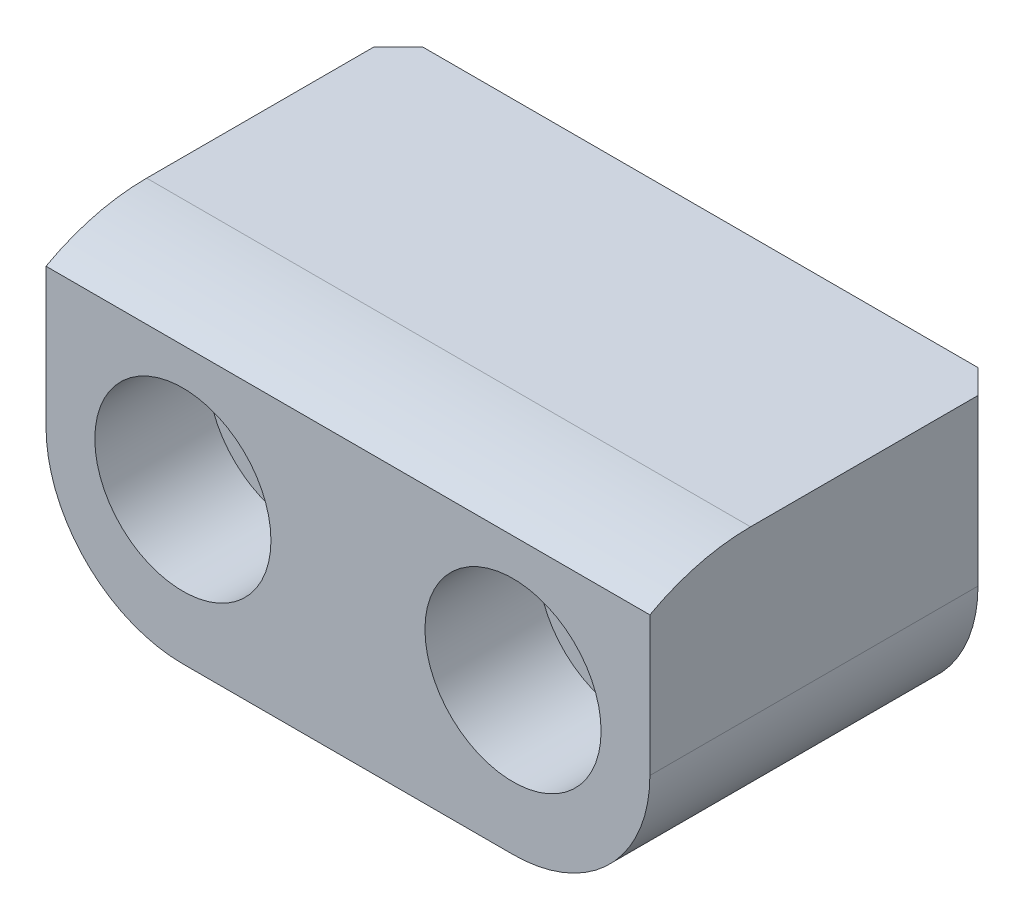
ISO-10303-21;
HEADER;
FILE_DESCRIPTION(('STEP AP214'),'2;1');
FILE_NAME('part.step','',(''),(''),'','','');
FILE_SCHEMA(('AUTOMOTIVE_DESIGN { 1 0 10303 214 1 1 1 1 }'));
ENDSEC;
DATA;
#1=APPLICATION_CONTEXT('core data for automotive mechanical design processes');
#2=APPLICATION_PROTOCOL_DEFINITION('international standard','automotive_design',2000,#1);
#3=PRODUCT_CONTEXT('',#1,'mechanical');
#4=PRODUCT('Part','Part','',(#3));
#5=PRODUCT_RELATED_PRODUCT_CATEGORY('part','',(#4));
#6=PRODUCT_DEFINITION_FORMATION('','',#4);
#7=PRODUCT_DEFINITION_CONTEXT('part definition',#1,'design');
#8=PRODUCT_DEFINITION('design','',#6,#7);
#9=PRODUCT_DEFINITION_SHAPE('','',#8);
#10=(LENGTH_UNIT() NAMED_UNIT(*) SI_UNIT(.MILLI.,.METRE.));
#11=(NAMED_UNIT(*) PLANE_ANGLE_UNIT() SI_UNIT($,.RADIAN.));
#12=(NAMED_UNIT(*) SI_UNIT($,.STERADIAN.) SOLID_ANGLE_UNIT());
#13=UNCERTAINTY_MEASURE_WITH_UNIT(LENGTH_MEASURE(1.E-05),#10,'distance_accuracy_value','');
#14=(GEOMETRIC_REPRESENTATION_CONTEXT(3) GLOBAL_UNCERTAINTY_ASSIGNED_CONTEXT((#13)) GLOBAL_UNIT_ASSIGNED_CONTEXT((#10,
#11,#12)) REPRESENTATION_CONTEXT('',''));
#15=CARTESIAN_POINT('',(0.,0.,0.));
#16=DIRECTION('',(0.,0.,1.));
#17=DIRECTION('',(1.,0.,0.));
#18=AXIS2_PLACEMENT_3D('',#15,#16,#17);
#19=CARTESIAN_POINT('',(0.,0.,-22.225));
#20=DIRECTION('',(-1.,0.,0.));
#21=DIRECTION('',(0.,-1.,0.));
#22=AXIS2_PLACEMENT_3D('',#19,#20,#21);
#23=PLANE('',#22);
#24=DIRECTION('',(0.,0.,1.));
#25=VECTOR('',#24,1.);
#26=CARTESIAN_POINT('',(0.,0.,-22.225));
#27=LINE('',#26,#25);
#28=CARTESIAN_POINT('',(0.,0.,-20.701));
#29=VERTEX_POINT('',#28);
#30=CARTESIAN_POINT('',(0.,0.,-6.35));
#31=VERTEX_POINT('',#30);
#32=EDGE_CURVE('E151',#29,#31,#27,.T.);
#33=ORIENTED_EDGE('',*,*,#32,.F.);
#34=DIRECTION('',(0.,-1.,0.));
#35=VECTOR('',#34,1.);
#36=CARTESIAN_POINT('',(0.,-10.414,-20.701));
#37=LINE('',#36,#35);
#38=CARTESIAN_POINT('',(0.,-10.414,-20.701));
#39=VERTEX_POINT('',#38);
#40=EDGE_CURVE('E165',#29,#39,#37,.T.);
#41=ORIENTED_EDGE('',*,*,#40,.T.);
#42=DIRECTION('',(0.,0.,1.));
#43=VECTOR('',#42,1.);
#44=CARTESIAN_POINT('',(0.,-10.414,-22.225));
#45=LINE('',#44,#43);
#46=CARTESIAN_POINT('',(0.,-10.414,0.));
#47=VERTEX_POINT('',#46);
#48=EDGE_CURVE('E153',#39,#47,#45,.T.);
#49=ORIENTED_EDGE('',*,*,#48,.T.);
#50=DIRECTION('',(0.,-1.,0.));
#51=VECTOR('',#50,1.);
#52=CARTESIAN_POINT('',(0.,0.,0.));
#53=LINE('',#52,#51);
#54=CARTESIAN_POINT('',(0.,-1.63663731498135,0.));
#55=VERTEX_POINT('',#54);
#56=EDGE_CURVE('E147',#55,#47,#53,.T.);
#57=ORIENTED_EDGE('',*,*,#56,.F.);
#58=CARTESIAN_POINT('',(0.,-13.1370222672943,-6.35));
#59=DIRECTION('',(1.,0.,0.));
#60=DIRECTION('',(0.,1.,0.));
#61=AXIS2_PLACEMENT_3D('',#58,#59,#60);
#62=CIRCLE('',#61,13.1370222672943);
#63=EDGE_CURVE('E123',#31,#55,#62,.T.);
#64=ORIENTED_EDGE('',*,*,#63,.F.);
#65=EDGE_LOOP('',(#33,#41,#49,#57,#64));
#66=FACE_BOUND('',#65,.T.);
#67=ADVANCED_FACE('F37',(#66),#23,.T.);
#68=CARTESIAN_POINT('',(0.,0.,-22.225));
#69=DIRECTION('',(0.,1.,0.));
#70=DIRECTION('',(0.,0.,1.));
#71=AXIS2_PLACEMENT_3D('',#68,#69,#70);
#72=PLANE('',#71);
#73=DIRECTION('',(-1.,0.,0.));
#74=VECTOR('',#73,1.);
#75=CARTESIAN_POINT('',(0.,0.,-22.225));
#76=LINE('',#75,#74);
#77=CARTESIAN_POINT('',(36.576,0.,-22.225));
#78=VERTEX_POINT('',#77);
#79=CARTESIAN_POINT('',(1.524,0.,-22.225));
#80=VERTEX_POINT('',#79);
#81=EDGE_CURVE('E142',#78,#80,#76,.T.);
#82=ORIENTED_EDGE('',*,*,#81,.T.);
#83=DIRECTION('',(-0.707106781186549,0.,0.707106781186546));
#84=VECTOR('',#83,1.);
#85=CARTESIAN_POINT('',(0.761999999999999,0.,-21.463));
#86=LINE('',#85,#84);
#87=EDGE_CURVE('E180',#80,#29,#86,.T.);
#88=ORIENTED_EDGE('',*,*,#87,.T.);
#89=ORIENTED_EDGE('',*,*,#32,.T.);
#90=DIRECTION('',(-1.,0.,0.));
#91=VECTOR('',#90,1.);
#92=CARTESIAN_POINT('',(38.1,0.,-6.35));
#93=LINE('',#92,#91);
#94=CARTESIAN_POINT('',(38.1,0.,-6.35));
#95=VERTEX_POINT('',#94);
#96=EDGE_CURVE('E128',#95,#31,#93,.T.);
#97=ORIENTED_EDGE('',*,*,#96,.F.);
#98=DIRECTION('',(0.,0.,1.));
#99=VECTOR('',#98,1.);
#100=CARTESIAN_POINT('',(38.1,0.,-22.225));
#101=LINE('',#100,#99);
#102=CARTESIAN_POINT('',(38.1,0.,-20.701));
#103=VERTEX_POINT('',#102);
#104=EDGE_CURVE('E135',#103,#95,#101,.T.);
#105=ORIENTED_EDGE('',*,*,#104,.F.);
#106=DIRECTION('',(-0.707106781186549,0.,-0.707106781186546));
#107=VECTOR('',#106,1.);
#108=CARTESIAN_POINT('',(18.2879999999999,0.,-40.513));
#109=LINE('',#108,#107);
#110=EDGE_CURVE('E178',#103,#78,#109,.T.);
#111=ORIENTED_EDGE('',*,*,#110,.T.);
#112=EDGE_LOOP('',(#82,#88,#89,#97,#105,#111));
#113=FACE_BOUND('',#112,.T.);
#114=ADVANCED_FACE('F250',(#113),#72,.T.);
#115=CARTESIAN_POINT('',(38.1,0.,-22.225));
#116=DIRECTION('',(1.,0.,0.));
#117=DIRECTION('',(0.,1.,0.));
#118=AXIS2_PLACEMENT_3D('',#115,#116,#117);
#119=PLANE('',#118);
#120=DIRECTION('',(0.,0.,1.));
#121=VECTOR('',#120,1.);
#122=CARTESIAN_POINT('',(38.1,-10.414,-22.225));
#123=LINE('',#122,#121);
#124=CARTESIAN_POINT('',(38.1,-10.414,0.));
#125=VERTEX_POINT('',#124);
#126=CARTESIAN_POINT('',(38.1,-10.414,-20.701));
#127=VERTEX_POINT('',#126);
#128=EDGE_CURVE('E163',#125,#127,#123,.F.);
#129=ORIENTED_EDGE('',*,*,#128,.T.);
#130=DIRECTION('',(0.,1.,0.));
#131=VECTOR('',#130,1.);
#132=CARTESIAN_POINT('',(38.1,0.,-20.701));
#133=LINE('',#132,#131);
#134=EDGE_CURVE('E11',#127,#103,#133,.T.);
#135=ORIENTED_EDGE('',*,*,#134,.T.);
#136=ORIENTED_EDGE('',*,*,#104,.T.);
#137=CARTESIAN_POINT('',(38.1,-13.1370222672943,-6.35));
#138=DIRECTION('',(1.,0.,0.));
#139=DIRECTION('',(0.,1.,0.));
#140=AXIS2_PLACEMENT_3D('',#137,#138,#139);
#141=CIRCLE('',#140,13.1370222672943);
#142=CARTESIAN_POINT('',(38.1,-1.63663731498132,0.));
#143=VERTEX_POINT('',#142);
#144=EDGE_CURVE('E120',#95,#143,#141,.T.);
#145=ORIENTED_EDGE('',*,*,#144,.T.);
#146=DIRECTION('',(0.,1.,0.));
#147=VECTOR('',#146,1.);
#148=CARTESIAN_POINT('',(38.1,0.,0.));
#149=LINE('',#148,#147);
#150=EDGE_CURVE('E133',#125,#143,#149,.T.);
#151=ORIENTED_EDGE('',*,*,#150,.F.);
#152=EDGE_LOOP('',(#129,#135,#136,#145,#151));
#153=FACE_BOUND('',#152,.T.);
#154=ADVANCED_FACE('F132',(#153),#119,.T.);
#155=CARTESIAN_POINT('',(0.,-19.05,-22.225));
#156=DIRECTION('',(0.,-1.,0.));
#157=DIRECTION('',(0.,0.,-1.));
#158=AXIS2_PLACEMENT_3D('',#155,#156,#157);
#159=PLANE('',#158);
#160=DIRECTION('',(0.,0.,1.));
#161=VECTOR('',#160,1.);
#162=CARTESIAN_POINT('',(8.636,-19.05,-22.225));
#163=LINE('',#162,#161);
#164=CARTESIAN_POINT('',(8.636,-19.05,0.));
#165=VERTEX_POINT('',#164);
#166=CARTESIAN_POINT('',(8.636,-19.05,-20.701));
#167=VERTEX_POINT('',#166);
#168=EDGE_CURVE('E161',#165,#167,#163,.F.);
#169=ORIENTED_EDGE('',*,*,#168,.T.);
#170=DIRECTION('',(1.,0.,0.));
#171=VECTOR('',#170,1.);
#172=CARTESIAN_POINT('',(29.464,-19.05,-20.701));
#173=LINE('',#172,#171);
#174=CARTESIAN_POINT('',(29.464,-19.05,-20.701));
#175=VERTEX_POINT('',#174);
#176=EDGE_CURVE('E61',#167,#175,#173,.T.);
#177=ORIENTED_EDGE('',*,*,#176,.T.);
#178=DIRECTION('',(0.,0.,1.));
#179=VECTOR('',#178,1.);
#180=CARTESIAN_POINT('',(29.464,-19.05,-22.225));
#181=LINE('',#180,#179);
#182=CARTESIAN_POINT('',(29.464,-19.05,0.));
#183=VERTEX_POINT('',#182);
#184=EDGE_CURVE('E159',#175,#183,#181,.T.);
#185=ORIENTED_EDGE('',*,*,#184,.T.);
#186=DIRECTION('',(1.,0.,0.));
#187=VECTOR('',#186,1.);
#188=CARTESIAN_POINT('',(0.,-19.05,0.));
#189=LINE('',#188,#187);
#190=EDGE_CURVE('E143',#165,#183,#189,.T.);
#191=ORIENTED_EDGE('',*,*,#190,.F.);
#192=EDGE_LOOP('',(#169,#177,#185,#191));
#193=FACE_BOUND('',#192,.T.);
#194=ADVANCED_FACE('F233',(#193),#159,.T.);
#195=CARTESIAN_POINT('',(0.,-19.05,-22.225));
#196=DIRECTION('',(0.,0.,1.));
#197=DIRECTION('',(1.,0.,0.));
#198=AXIS2_PLACEMENT_3D('',#195,#196,#197);
#199=PLANE('',#198);
#200=CARTESIAN_POINT('',(8.636,-9.525,-22.225));
#201=DIRECTION('',(0.,0.,1.));
#202=DIRECTION('',(1.,0.,0.));
#203=AXIS2_PLACEMENT_3D('',#200,#201,#202);
#204=CIRCLE('',#203,3.2639);
#205=CARTESIAN_POINT('',(11.8999,-9.525,-22.225));
#206=VERTEX_POINT('',#205);
#207=EDGE_CURVE('E211',#206,#206,#204,.T.);
#208=ORIENTED_EDGE('',*,*,#207,.T.);
#209=EDGE_LOOP('',(#208));
#210=FACE_BOUND('',#209,.T.);
#211=CARTESIAN_POINT('',(29.464,-9.525,-22.225));
#212=DIRECTION('',(0.,0.,1.));
#213=DIRECTION('',(1.,0.,0.));
#214=AXIS2_PLACEMENT_3D('',#211,#212,#213);
#215=CIRCLE('',#214,3.26389999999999);
#216=CARTESIAN_POINT('',(32.7279,-9.525,-22.225));
#217=VERTEX_POINT('',#216);
#218=EDGE_CURVE('E223',#217,#217,#215,.T.);
#219=ORIENTED_EDGE('',*,*,#218,.T.);
#220=EDGE_LOOP('',(#219));
#221=FACE_BOUND('',#220,.T.);
#222=CARTESIAN_POINT('',(8.636,-10.414,-22.225));
#223=DIRECTION('',(0.,0.,1.));
#224=DIRECTION('',(1.,0.,0.));
#225=AXIS2_PLACEMENT_3D('',#222,#223,#224);
#226=CIRCLE('',#225,7.11199999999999);
#227=CARTESIAN_POINT('',(8.636,-17.526,-22.225));
#228=VERTEX_POINT('',#227);
#229=CARTESIAN_POINT('',(1.52400000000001,-10.414,-22.225));
#230=VERTEX_POINT('',#229);
#231=EDGE_CURVE('E174',#228,#230,#226,.F.);
#232=ORIENTED_EDGE('',*,*,#231,.T.);
#233=DIRECTION('',(0.,1.,0.));
#234=VECTOR('',#233,1.);
#235=CARTESIAN_POINT('',(1.524,0.,-22.225));
#236=LINE('',#235,#234);
#237=EDGE_CURVE('E176',#230,#80,#236,.T.);
#238=ORIENTED_EDGE('',*,*,#237,.T.);
#239=ORIENTED_EDGE('',*,*,#81,.F.);
#240=DIRECTION('',(0.,-1.,0.));
#241=VECTOR('',#240,1.);
#242=CARTESIAN_POINT('',(36.576,-10.414,-22.225));
#243=LINE('',#242,#241);
#244=CARTESIAN_POINT('',(36.576,-10.414,-22.225));
#245=VERTEX_POINT('',#244);
#246=EDGE_CURVE('E168',#78,#245,#243,.T.);
#247=ORIENTED_EDGE('',*,*,#246,.T.);
#248=CARTESIAN_POINT('',(29.464,-10.414,-22.225));
#249=DIRECTION('',(0.,0.,1.));
#250=DIRECTION('',(1.,0.,0.));
#251=AXIS2_PLACEMENT_3D('',#248,#249,#250);
#252=CIRCLE('',#251,7.11199999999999);
#253=CARTESIAN_POINT('',(29.464,-17.526,-22.225));
#254=VERTEX_POINT('',#253);
#255=EDGE_CURVE('E170',#245,#254,#252,.F.);
#256=ORIENTED_EDGE('',*,*,#255,.T.);
#257=DIRECTION('',(-1.,0.,0.));
#258=VECTOR('',#257,1.);
#259=CARTESIAN_POINT('',(8.636,-17.526,-22.225));
#260=LINE('',#259,#258);
#261=EDGE_CURVE('E172',#254,#228,#260,.T.);
#262=ORIENTED_EDGE('',*,*,#261,.T.);
#263=EDGE_LOOP('',(#232,#238,#239,#247,#256,#262));
#264=FACE_BOUND('',#263,.T.);
#265=ADVANCED_FACE('F242',(#210,#221,#264),#199,.F.);
#266=CARTESIAN_POINT('',(0.,-19.05,0.));
#267=DIRECTION('',(0.,0.,1.));
#268=DIRECTION('',(1.,0.,0.));
#269=AXIS2_PLACEMENT_3D('',#266,#267,#268);
#270=PLANE('',#269);
#271=DIRECTION('',(-1.,0.,0.));
#272=VECTOR('',#271,1.);
#273=CARTESIAN_POINT('',(38.1,-1.63663731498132,0.));
#274=LINE('',#273,#272);
#275=EDGE_CURVE('E116',#143,#55,#274,.T.);
#276=ORIENTED_EDGE('',*,*,#275,.T.);
#277=ORIENTED_EDGE('',*,*,#56,.T.);
#278=CARTESIAN_POINT('',(8.636,-10.414,0.));
#279=DIRECTION('',(0.,0.,1.));
#280=DIRECTION('',(1.,0.,0.));
#281=AXIS2_PLACEMENT_3D('',#278,#279,#280);
#282=CIRCLE('',#281,8.636);
#283=EDGE_CURVE('E157',#47,#165,#282,.T.);
#284=ORIENTED_EDGE('',*,*,#283,.T.);
#285=ORIENTED_EDGE('',*,*,#190,.T.);
#286=CARTESIAN_POINT('',(29.464,-10.414,0.));
#287=DIRECTION('',(0.,0.,1.));
#288=DIRECTION('',(1.,0.,0.));
#289=AXIS2_PLACEMENT_3D('',#286,#287,#288);
#290=CIRCLE('',#289,8.636);
#291=EDGE_CURVE('E141',#183,#125,#290,.T.);
#292=ORIENTED_EDGE('',*,*,#291,.T.);
#293=ORIENTED_EDGE('',*,*,#150,.T.);
#294=EDGE_LOOP('',(#276,#277,#284,#285,#292,#293));
#295=FACE_BOUND('',#294,.T.);
#296=CARTESIAN_POINT('',(8.636,-9.525,0.));
#297=DIRECTION('',(0.,0.,1.));
#298=DIRECTION('',(1.,0.,0.));
#299=AXIS2_PLACEMENT_3D('',#296,#297,#298);
#300=CIRCLE('',#299,5.55625);
#301=CARTESIAN_POINT('',(14.19225,-9.525,0.));
#302=VERTEX_POINT('',#301);
#303=EDGE_CURVE('E201',#302,#302,#300,.T.);
#304=ORIENTED_EDGE('',*,*,#303,.F.);
#305=EDGE_LOOP('',(#304));
#306=FACE_BOUND('',#305,.T.);
#307=CARTESIAN_POINT('',(29.464,-9.525,0.));
#308=DIRECTION('',(0.,0.,1.));
#309=DIRECTION('',(1.,0.,0.));
#310=AXIS2_PLACEMENT_3D('',#307,#308,#309);
#311=CIRCLE('',#310,5.55625);
#312=CARTESIAN_POINT('',(35.02025,-9.525,0.));
#313=VERTEX_POINT('',#312);
#314=EDGE_CURVE('E214',#313,#313,#311,.T.);
#315=ORIENTED_EDGE('',*,*,#314,.F.);
#316=EDGE_LOOP('',(#315));
#317=FACE_BOUND('',#316,.T.);
#318=ADVANCED_FACE('F137',(#295,#306,#317),#270,.T.);
#319=CARTESIAN_POINT('',(8.636,-10.414,-22.225));
#320=DIRECTION('',(0.,0.,1.));
#321=DIRECTION('',(1.,0.,0.));
#322=AXIS2_PLACEMENT_3D('',#319,#320,#321);
#323=CYLINDRICAL_SURFACE('',#322,8.636);
#324=ORIENTED_EDGE('',*,*,#48,.F.);
#325=CARTESIAN_POINT('',(8.636,-10.414,-20.701));
#326=DIRECTION('',(0.,0.,1.));
#327=DIRECTION('',(1.,0.,0.));
#328=AXIS2_PLACEMENT_3D('',#325,#326,#327);
#329=CIRCLE('',#328,8.636);
#330=EDGE_CURVE('E182',#39,#167,#329,.T.);
#331=ORIENTED_EDGE('',*,*,#330,.T.);
#332=ORIENTED_EDGE('',*,*,#168,.F.);
#333=ORIENTED_EDGE('',*,*,#283,.F.);
#334=EDGE_LOOP('',(#324,#331,#332,#333));
#335=FACE_BOUND('',#334,.T.);
#336=ADVANCED_FACE('F231',(#335),#323,.T.);
#337=CARTESIAN_POINT('',(29.464,-10.414,-22.225));
#338=DIRECTION('',(0.,0.,1.));
#339=DIRECTION('',(1.,0.,0.));
#340=AXIS2_PLACEMENT_3D('',#337,#338,#339);
#341=CYLINDRICAL_SURFACE('',#340,8.636);
#342=ORIENTED_EDGE('',*,*,#184,.F.);
#343=CARTESIAN_POINT('',(29.464,-10.414,-20.701));
#344=DIRECTION('',(0.,0.,1.));
#345=DIRECTION('',(1.,0.,0.));
#346=AXIS2_PLACEMENT_3D('',#343,#344,#345);
#347=CIRCLE('',#346,8.636);
#348=EDGE_CURVE('E46',#175,#127,#347,.T.);
#349=ORIENTED_EDGE('',*,*,#348,.T.);
#350=ORIENTED_EDGE('',*,*,#128,.F.);
#351=ORIENTED_EDGE('',*,*,#291,.F.);
#352=EDGE_LOOP('',(#342,#349,#350,#351));
#353=FACE_BOUND('',#352,.T.);
#354=ADVANCED_FACE('F262',(#353),#341,.T.);
#355=CARTESIAN_POINT('',(29.464,-9.525,0.));
#356=DIRECTION('',(0.,0.,1.));
#357=DIRECTION('',(1.,0.,0.));
#358=AXIS2_PLACEMENT_3D('',#355,#356,#357);
#359=CYLINDRICAL_SURFACE('',#358,3.2639);
#360=ORIENTED_EDGE('',*,*,#218,.F.);
#361=EDGE_LOOP('',(#360));
#362=FACE_BOUND('',#361,.T.);
#363=CARTESIAN_POINT('',(29.464,-9.525,-7.14375));
#364=DIRECTION('',(0.,0.,1.));
#365=DIRECTION('',(1.,0.,0.));
#366=AXIS2_PLACEMENT_3D('',#363,#364,#365);
#367=CIRCLE('',#366,3.2639);
#368=CARTESIAN_POINT('',(32.7279,-9.525,-7.14375));
#369=VERTEX_POINT('',#368);
#370=EDGE_CURVE('E220',#369,#369,#367,.T.);
#371=ORIENTED_EDGE('',*,*,#370,.T.);
#372=EDGE_LOOP('',(#371));
#373=FACE_BOUND('',#372,.T.);
#374=ADVANCED_FACE('F265',(#362,#373),#359,.F.);
#375=CARTESIAN_POINT('',(32.7279,-9.525,-7.14375));
#376=DIRECTION('',(0.,0.,-1.));
#377=DIRECTION('',(-1.,0.,0.));
#378=AXIS2_PLACEMENT_3D('',#375,#376,#377);
#379=PLANE('',#378);
#380=ORIENTED_EDGE('',*,*,#370,.F.);
#381=EDGE_LOOP('',(#380));
#382=FACE_BOUND('',#381,.T.);
#383=CARTESIAN_POINT('',(29.464,-9.525,-7.14375));
#384=DIRECTION('',(0.,0.,1.));
#385=DIRECTION('',(1.,0.,0.));
#386=AXIS2_PLACEMENT_3D('',#383,#384,#385);
#387=CIRCLE('',#386,5.55625);
#388=CARTESIAN_POINT('',(35.02025,-9.525,-7.14375));
#389=VERTEX_POINT('',#388);
#390=EDGE_CURVE('E217',#389,#389,#387,.T.);
#391=ORIENTED_EDGE('',*,*,#390,.T.);
#392=EDGE_LOOP('',(#391));
#393=FACE_BOUND('',#392,.T.);
#394=ADVANCED_FACE('F302',(#382,#393),#379,.F.);
#395=CARTESIAN_POINT('',(29.464,-9.525,0.));
#396=DIRECTION('',(0.,0.,1.));
#397=DIRECTION('',(1.,0.,0.));
#398=AXIS2_PLACEMENT_3D('',#395,#396,#397);
#399=CYLINDRICAL_SURFACE('',#398,5.55625);
#400=ORIENTED_EDGE('',*,*,#390,.F.);
#401=EDGE_LOOP('',(#400));
#402=FACE_BOUND('',#401,.T.);
#403=ORIENTED_EDGE('',*,*,#314,.T.);
#404=EDGE_LOOP('',(#403));
#405=FACE_BOUND('',#404,.T.);
#406=ADVANCED_FACE('F298',(#402,#405),#399,.F.);
#407=CARTESIAN_POINT('',(8.636,-9.525,0.));
#408=DIRECTION('',(0.,0.,1.));
#409=DIRECTION('',(1.,0.,0.));
#410=AXIS2_PLACEMENT_3D('',#407,#408,#409);
#411=CYLINDRICAL_SURFACE('',#410,3.2639);
#412=ORIENTED_EDGE('',*,*,#207,.F.);
#413=EDGE_LOOP('',(#412));
#414=FACE_BOUND('',#413,.T.);
#415=CARTESIAN_POINT('',(8.636,-9.525,-7.14375));
#416=DIRECTION('',(0.,0.,1.));
#417=DIRECTION('',(1.,0.,0.));
#418=AXIS2_PLACEMENT_3D('',#415,#416,#417);
#419=CIRCLE('',#418,3.2639);
#420=CARTESIAN_POINT('',(11.8999,-9.525,-7.14375));
#421=VERTEX_POINT('',#420);
#422=EDGE_CURVE('E208',#421,#421,#419,.T.);
#423=ORIENTED_EDGE('',*,*,#422,.T.);
#424=EDGE_LOOP('',(#423));
#425=FACE_BOUND('',#424,.T.);
#426=ADVANCED_FACE('F294',(#414,#425),#411,.F.);
#427=CARTESIAN_POINT('',(11.8999,-9.525,-7.14375));
#428=DIRECTION('',(0.,0.,-1.));
#429=DIRECTION('',(-1.,0.,0.));
#430=AXIS2_PLACEMENT_3D('',#427,#428,#429);
#431=PLANE('',#430);
#432=ORIENTED_EDGE('',*,*,#422,.F.);
#433=EDGE_LOOP('',(#432));
#434=FACE_BOUND('',#433,.T.);
#435=CARTESIAN_POINT('',(8.636,-9.525,-7.14375));
#436=DIRECTION('',(0.,0.,1.));
#437=DIRECTION('',(1.,0.,0.));
#438=AXIS2_PLACEMENT_3D('',#435,#436,#437);
#439=CIRCLE('',#438,5.55625);
#440=CARTESIAN_POINT('',(14.19225,-9.525,-7.14375));
#441=VERTEX_POINT('',#440);
#442=EDGE_CURVE('E205',#441,#441,#439,.T.);
#443=ORIENTED_EDGE('',*,*,#442,.T.);
#444=EDGE_LOOP('',(#443));
#445=FACE_BOUND('',#444,.T.);
#446=ADVANCED_FACE('F288',(#434,#445),#431,.F.);
#447=CARTESIAN_POINT('',(8.636,-9.525,0.));
#448=DIRECTION('',(0.,0.,1.));
#449=DIRECTION('',(1.,0.,0.));
#450=AXIS2_PLACEMENT_3D('',#447,#448,#449);
#451=CYLINDRICAL_SURFACE('',#450,5.55625);
#452=ORIENTED_EDGE('',*,*,#442,.F.);
#453=EDGE_LOOP('',(#452));
#454=FACE_BOUND('',#453,.T.);
#455=ORIENTED_EDGE('',*,*,#303,.T.);
#456=EDGE_LOOP('',(#455));
#457=FACE_BOUND('',#456,.T.);
#458=ADVANCED_FACE('F280',(#454,#457),#451,.F.);
#459=CARTESIAN_POINT('',(38.1,-13.1370222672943,-6.35));
#460=DIRECTION('',(-1.,0.,0.));
#461=DIRECTION('',(0.,-1.,0.));
#462=AXIS2_PLACEMENT_3D('',#459,#460,#461);
#463=CYLINDRICAL_SURFACE('',#462,13.1370222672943);
#464=ORIENTED_EDGE('',*,*,#63,.T.);
#465=ORIENTED_EDGE('',*,*,#275,.F.);
#466=ORIENTED_EDGE('',*,*,#144,.F.);
#467=ORIENTED_EDGE('',*,*,#96,.T.);
#468=EDGE_LOOP('',(#464,#465,#466,#467));
#469=FACE_BOUND('',#468,.T.);
#470=ADVANCED_FACE('F118',(#469),#463,.T.);
#471=CARTESIAN_POINT('',(38.1,0.,-20.701));
#472=DIRECTION('',(0.707106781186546,0.,-0.707106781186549));
#473=DIRECTION('',(0.,-1.,0.));
#474=AXIS2_PLACEMENT_3D('',#471,#472,#473);
#475=PLANE('',#474);
#476=ORIENTED_EDGE('',*,*,#110,.F.);
#477=ORIENTED_EDGE('',*,*,#134,.F.);
#478=DIRECTION('',(0.707106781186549,0.,0.707106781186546));
#479=VECTOR('',#478,1.);
#480=CARTESIAN_POINT('',(36.576,-10.414,-22.225));
#481=LINE('',#480,#479);
#482=EDGE_CURVE('E41',#245,#127,#481,.T.);
#483=ORIENTED_EDGE('',*,*,#482,.F.);
#484=ORIENTED_EDGE('',*,*,#246,.F.);
#485=EDGE_LOOP('',(#476,#477,#483,#484));
#486=FACE_BOUND('',#485,.T.);
#487=ADVANCED_FACE('F39',(#486),#475,.T.);
#488=CARTESIAN_POINT('',(29.464,-10.414,-22.225));
#489=DIRECTION('',(0.,0.,1.));
#490=DIRECTION('',(1.,0.,0.));
#491=AXIS2_PLACEMENT_3D('',#488,#489,#490);
#492=CONICAL_SURFACE('',#491,7.11199999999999,0.785398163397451);
#493=ORIENTED_EDGE('',*,*,#482,.T.);
#494=ORIENTED_EDGE('',*,*,#348,.F.);
#495=DIRECTION('',(0.,-0.707106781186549,0.707106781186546));
#496=VECTOR('',#495,1.);
#497=CARTESIAN_POINT('',(29.464,-17.526,-22.225));
#498=LINE('',#497,#496);
#499=EDGE_CURVE('E190',#254,#175,#498,.T.);
#500=ORIENTED_EDGE('',*,*,#499,.F.);
#501=ORIENTED_EDGE('',*,*,#255,.F.);
#502=EDGE_LOOP('',(#493,#494,#500,#501));
#503=FACE_BOUND('',#502,.T.);
#504=ADVANCED_FACE('F271',(#503),#492,.T.);
#505=CARTESIAN_POINT('',(0.,-19.05,-20.701));
#506=DIRECTION('',(0.,-0.707106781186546,-0.707106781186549));
#507=DIRECTION('',(-1.,0.,0.));
#508=AXIS2_PLACEMENT_3D('',#505,#506,#507);
#509=PLANE('',#508);
#510=ORIENTED_EDGE('',*,*,#499,.T.);
#511=ORIENTED_EDGE('',*,*,#176,.F.);
#512=DIRECTION('',(0.,-0.707106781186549,0.707106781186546));
#513=VECTOR('',#512,1.);
#514=CARTESIAN_POINT('',(8.636,-17.526,-22.225));
#515=LINE('',#514,#513);
#516=EDGE_CURVE('E188',#228,#167,#515,.T.);
#517=ORIENTED_EDGE('',*,*,#516,.F.);
#518=ORIENTED_EDGE('',*,*,#261,.F.);
#519=EDGE_LOOP('',(#510,#511,#517,#518));
#520=FACE_BOUND('',#519,.T.);
#521=ADVANCED_FACE('F235',(#520),#509,.T.);
#522=CARTESIAN_POINT('',(8.636,-10.414,-22.225));
#523=DIRECTION('',(0.,0.,1.));
#524=DIRECTION('',(1.,0.,0.));
#525=AXIS2_PLACEMENT_3D('',#522,#523,#524);
#526=CONICAL_SURFACE('',#525,7.11199999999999,0.785398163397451);
#527=ORIENTED_EDGE('',*,*,#516,.T.);
#528=ORIENTED_EDGE('',*,*,#330,.F.);
#529=DIRECTION('',(-0.707106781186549,0.,0.707106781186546));
#530=VECTOR('',#529,1.);
#531=CARTESIAN_POINT('',(1.52400000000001,-10.414,-22.225));
#532=LINE('',#531,#530);
#533=EDGE_CURVE('E186',#230,#39,#532,.T.);
#534=ORIENTED_EDGE('',*,*,#533,.F.);
#535=ORIENTED_EDGE('',*,*,#231,.F.);
#536=EDGE_LOOP('',(#527,#528,#534,#535));
#537=FACE_BOUND('',#536,.T.);
#538=ADVANCED_FACE('F238',(#537),#526,.T.);
#539=CARTESIAN_POINT('',(0.,0.,-20.701));
#540=DIRECTION('',(-0.707106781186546,0.,-0.707106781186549));
#541=DIRECTION('',(0.,1.,0.));
#542=AXIS2_PLACEMENT_3D('',#539,#540,#541);
#543=PLANE('',#542);
#544=ORIENTED_EDGE('',*,*,#87,.F.);
#545=ORIENTED_EDGE('',*,*,#237,.F.);
#546=ORIENTED_EDGE('',*,*,#533,.T.);
#547=ORIENTED_EDGE('',*,*,#40,.F.);
#548=EDGE_LOOP('',(#544,#545,#546,#547));
#549=FACE_BOUND('',#548,.T.);
#550=ADVANCED_FACE('F246',(#549),#543,.T.);
#551=CLOSED_SHELL('',(#67,#114,#154,#194,#265,#318,#336,#354,#374,#394,#406,#426,#446,#458,#470,
#487,#504,#521,#538,#550));
#552=MANIFOLD_SOLID_BREP('B2',#551);
#553=ADVANCED_BREP_SHAPE_REPRESENTATION('',(#18,#552),#14);
#554=SHAPE_DEFINITION_REPRESENTATION(#9,#553);
ENDSEC;
END-ISO-10303-21;
